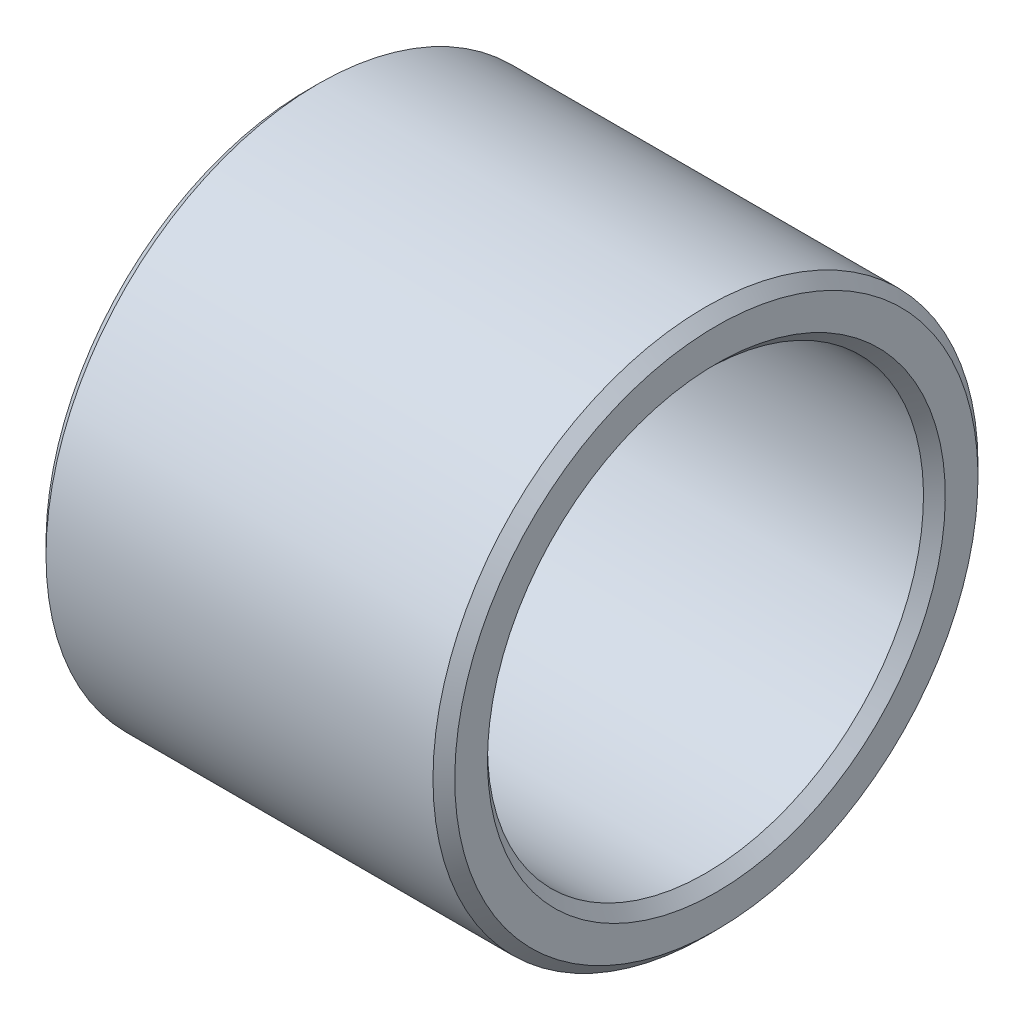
ISO-10303-21;
HEADER;
FILE_DESCRIPTION(('STEP AP214'),'2;1');
FILE_NAME('part.step','',(''),(''),'','','');
FILE_SCHEMA(('AUTOMOTIVE_DESIGN { 1 0 10303 214 1 1 1 1 }'));
ENDSEC;
DATA;
#1=APPLICATION_CONTEXT('core data for automotive mechanical design processes');
#2=APPLICATION_PROTOCOL_DEFINITION('international standard','automotive_design',2000,#1);
#3=PRODUCT_CONTEXT('',#1,'mechanical');
#4=PRODUCT('Part','Part','',(#3));
#5=PRODUCT_RELATED_PRODUCT_CATEGORY('part','',(#4));
#6=PRODUCT_DEFINITION_FORMATION('','',#4);
#7=PRODUCT_DEFINITION_CONTEXT('part definition',#1,'design');
#8=PRODUCT_DEFINITION('design','',#6,#7);
#9=PRODUCT_DEFINITION_SHAPE('','',#8);
#10=(LENGTH_UNIT() NAMED_UNIT(*) SI_UNIT(.MILLI.,.METRE.));
#11=(NAMED_UNIT(*) PLANE_ANGLE_UNIT() SI_UNIT($,.RADIAN.));
#12=(NAMED_UNIT(*) SI_UNIT($,.STERADIAN.) SOLID_ANGLE_UNIT());
#13=UNCERTAINTY_MEASURE_WITH_UNIT(LENGTH_MEASURE(1.E-05),#10,'distance_accuracy_value','');
#14=(GEOMETRIC_REPRESENTATION_CONTEXT(3) GLOBAL_UNCERTAINTY_ASSIGNED_CONTEXT((#13)) GLOBAL_UNIT_ASSIGNED_CONTEXT((#10,
#11,#12)) REPRESENTATION_CONTEXT('',''));
#15=CARTESIAN_POINT('',(0.,0.,0.));
#16=DIRECTION('',(0.,0.,1.));
#17=DIRECTION('',(1.,0.,0.));
#18=AXIS2_PLACEMENT_3D('',#15,#16,#17);
#19=CARTESIAN_POINT('',(0.,-9.,0.));
#20=DIRECTION('',(-1.,0.,0.));
#21=DIRECTION('',(0.,1.,0.));
#22=AXIS2_PLACEMENT_3D('',#19,#20,#21);
#23=PLANE('',#22);
#24=CARTESIAN_POINT('',(0.,0.,0.));
#25=DIRECTION('',(1.,0.,0.));
#26=DIRECTION('',(0.,-1.,0.));
#27=AXIS2_PLACEMENT_3D('',#24,#25,#26);
#28=CIRCLE('',#27,8.4);
#29=CARTESIAN_POINT('',(0.,-8.4,0.));
#30=VERTEX_POINT('',#29);
#31=EDGE_CURVE('E9',#30,#30,#28,.T.);
#32=ORIENTED_EDGE('',*,*,#31,.T.);
#33=EDGE_LOOP('',(#32));
#34=FACE_BOUND('',#33,.T.);
#35=CARTESIAN_POINT('',(0.,0.,0.));
#36=DIRECTION('',(1.,0.,0.));
#37=DIRECTION('',(0.,-1.,0.));
#38=AXIS2_PLACEMENT_3D('',#35,#36,#37);
#39=CIRCLE('',#38,9.6);
#40=CARTESIAN_POINT('',(0.,-9.6,0.));
#41=VERTEX_POINT('',#40);
#42=EDGE_CURVE('E19',#41,#41,#39,.T.);
#43=ORIENTED_EDGE('',*,*,#42,.F.);
#44=EDGE_LOOP('',(#43));
#45=FACE_BOUND('',#44,.T.);
#46=ADVANCED_FACE('F15',(#34,#45),#23,.T.);
#47=CARTESIAN_POINT('',(0.2,0.,0.));
#48=DIRECTION('',(-1.,0.,0.));
#49=DIRECTION('',(0.,-1.,0.));
#50=AXIS2_PLACEMENT_3D('',#47,#48,#49);
#51=CONICAL_SURFACE('',#50,8.2,0.785398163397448);
#52=CARTESIAN_POINT('',(0.4,0.,0.));
#53=DIRECTION('',(1.,0.,0.));
#54=DIRECTION('',(0.,-1.,0.));
#55=AXIS2_PLACEMENT_3D('',#52,#53,#54);
#56=CIRCLE('',#55,8.);
#57=CARTESIAN_POINT('',(0.4,-8.,0.));
#58=VERTEX_POINT('',#57);
#59=EDGE_CURVE('E24',#58,#58,#56,.T.);
#60=ORIENTED_EDGE('',*,*,#59,.T.);
#61=EDGE_LOOP('',(#60));
#62=FACE_BOUND('',#61,.T.);
#63=ORIENTED_EDGE('',*,*,#31,.F.);
#64=EDGE_LOOP('',(#63));
#65=FACE_BOUND('',#64,.T.);
#66=ADVANCED_FACE('F86',(#62,#65),#51,.F.);
#67=CARTESIAN_POINT('',(7.5,0.,0.));
#68=DIRECTION('',(-1.,0.,0.));
#69=DIRECTION('',(0.,-1.,0.));
#70=AXIS2_PLACEMENT_3D('',#67,#68,#69);
#71=CYLINDRICAL_SURFACE('',#70,8.);
#72=CARTESIAN_POINT('',(14.6,0.,0.));
#73=DIRECTION('',(1.,0.,0.));
#74=DIRECTION('',(0.,-1.,0.));
#75=AXIS2_PLACEMENT_3D('',#72,#73,#74);
#76=CIRCLE('',#75,8.);
#77=CARTESIAN_POINT('',(14.6,-8.,0.));
#78=VERTEX_POINT('',#77);
#79=EDGE_CURVE('E64',#78,#78,#76,.T.);
#80=ORIENTED_EDGE('',*,*,#79,.T.);
#81=EDGE_LOOP('',(#80));
#82=FACE_BOUND('',#81,.T.);
#83=ORIENTED_EDGE('',*,*,#59,.F.);
#84=EDGE_LOOP('',(#83));
#85=FACE_BOUND('',#84,.T.);
#86=ADVANCED_FACE('F91',(#82,#85),#71,.F.);
#87=CARTESIAN_POINT('',(14.8,0.,0.));
#88=DIRECTION('',(1.,0.,0.));
#89=DIRECTION('',(0.,-1.,0.));
#90=AXIS2_PLACEMENT_3D('',#87,#88,#89);
#91=CONICAL_SURFACE('',#90,8.2,0.785398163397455);
#92=CARTESIAN_POINT('',(15.,0.,0.));
#93=DIRECTION('',(1.,0.,0.));
#94=DIRECTION('',(0.,-1.,0.));
#95=AXIS2_PLACEMENT_3D('',#92,#93,#94);
#96=CIRCLE('',#95,8.4);
#97=CARTESIAN_POINT('',(15.,-8.4,0.));
#98=VERTEX_POINT('',#97);
#99=EDGE_CURVE('E60',#98,#98,#96,.T.);
#100=ORIENTED_EDGE('',*,*,#99,.T.);
#101=EDGE_LOOP('',(#100));
#102=FACE_BOUND('',#101,.T.);
#103=ORIENTED_EDGE('',*,*,#79,.F.);
#104=EDGE_LOOP('',(#103));
#105=FACE_BOUND('',#104,.T.);
#106=ADVANCED_FACE('F61',(#102,#105),#91,.F.);
#107=CARTESIAN_POINT('',(15.,-9.,0.));
#108=DIRECTION('',(1.,0.,0.));
#109=DIRECTION('',(0.,-1.,0.));
#110=AXIS2_PLACEMENT_3D('',#107,#108,#109);
#111=PLANE('',#110);
#112=CARTESIAN_POINT('',(15.,0.,0.));
#113=DIRECTION('',(1.,0.,0.));
#114=DIRECTION('',(0.,-1.,0.));
#115=AXIS2_PLACEMENT_3D('',#112,#113,#114);
#116=CIRCLE('',#115,9.6);
#117=CARTESIAN_POINT('',(15.,-9.6,0.));
#118=VERTEX_POINT('',#117);
#119=EDGE_CURVE('E65',#118,#118,#116,.T.);
#120=ORIENTED_EDGE('',*,*,#119,.T.);
#121=EDGE_LOOP('',(#120));
#122=FACE_BOUND('',#121,.T.);
#123=ORIENTED_EDGE('',*,*,#99,.F.);
#124=EDGE_LOOP('',(#123));
#125=FACE_BOUND('',#124,.T.);
#126=ADVANCED_FACE('F73',(#122,#125),#111,.T.);
#127=CARTESIAN_POINT('',(14.8,0.,0.));
#128=DIRECTION('',(-1.,0.,0.));
#129=DIRECTION('',(0.,-1.,0.));
#130=AXIS2_PLACEMENT_3D('',#127,#128,#129);
#131=CONICAL_SURFACE('',#130,9.8,0.785398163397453);
#132=CARTESIAN_POINT('',(14.6,0.,0.));
#133=DIRECTION('',(1.,0.,0.));
#134=DIRECTION('',(0.,-1.,0.));
#135=AXIS2_PLACEMENT_3D('',#132,#133,#134);
#136=CIRCLE('',#135,10.);
#137=CARTESIAN_POINT('',(14.6,-10.,0.));
#138=VERTEX_POINT('',#137);
#139=EDGE_CURVE('E54',#138,#138,#136,.T.);
#140=ORIENTED_EDGE('',*,*,#139,.T.);
#141=EDGE_LOOP('',(#140));
#142=FACE_BOUND('',#141,.T.);
#143=ORIENTED_EDGE('',*,*,#119,.F.);
#144=EDGE_LOOP('',(#143));
#145=FACE_BOUND('',#144,.T.);
#146=ADVANCED_FACE('F17',(#142,#145),#131,.T.);
#147=CARTESIAN_POINT('',(7.5,0.,0.));
#148=DIRECTION('',(-1.,0.,0.));
#149=DIRECTION('',(0.,-1.,0.));
#150=AXIS2_PLACEMENT_3D('',#147,#148,#149);
#151=CYLINDRICAL_SURFACE('',#150,10.);
#152=CARTESIAN_POINT('',(0.4,0.,0.));
#153=DIRECTION('',(1.,0.,0.));
#154=DIRECTION('',(0.,-1.,0.));
#155=AXIS2_PLACEMENT_3D('',#152,#153,#154);
#156=CIRCLE('',#155,10.);
#157=CARTESIAN_POINT('',(0.4,-10.,0.));
#158=VERTEX_POINT('',#157);
#159=EDGE_CURVE('E44',#158,#158,#156,.T.);
#160=ORIENTED_EDGE('',*,*,#159,.T.);
#161=EDGE_LOOP('',(#160));
#162=FACE_BOUND('',#161,.T.);
#163=ORIENTED_EDGE('',*,*,#139,.F.);
#164=EDGE_LOOP('',(#163));
#165=FACE_BOUND('',#164,.T.);
#166=ADVANCED_FACE('F76',(#162,#165),#151,.T.);
#167=CARTESIAN_POINT('',(0.2,0.,0.));
#168=DIRECTION('',(1.,0.,0.));
#169=DIRECTION('',(0.,-1.,0.));
#170=AXIS2_PLACEMENT_3D('',#167,#168,#169);
#171=CONICAL_SURFACE('',#170,9.8,0.785398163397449);
#172=ORIENTED_EDGE('',*,*,#42,.T.);
#173=EDGE_LOOP('',(#172));
#174=FACE_BOUND('',#173,.T.);
#175=ORIENTED_EDGE('',*,*,#159,.F.);
#176=EDGE_LOOP('',(#175));
#177=FACE_BOUND('',#176,.T.);
#178=ADVANCED_FACE('F82',(#174,#177),#171,.T.);
#179=CLOSED_SHELL('',(#46,#66,#86,#106,#126,#146,#166,#178));
#180=MANIFOLD_SOLID_BREP('B1',#179);
#181=ADVANCED_BREP_SHAPE_REPRESENTATION('',(#18,#180),#14);
#182=SHAPE_DEFINITION_REPRESENTATION(#9,#181);
ENDSEC;
END-ISO-10303-21;
